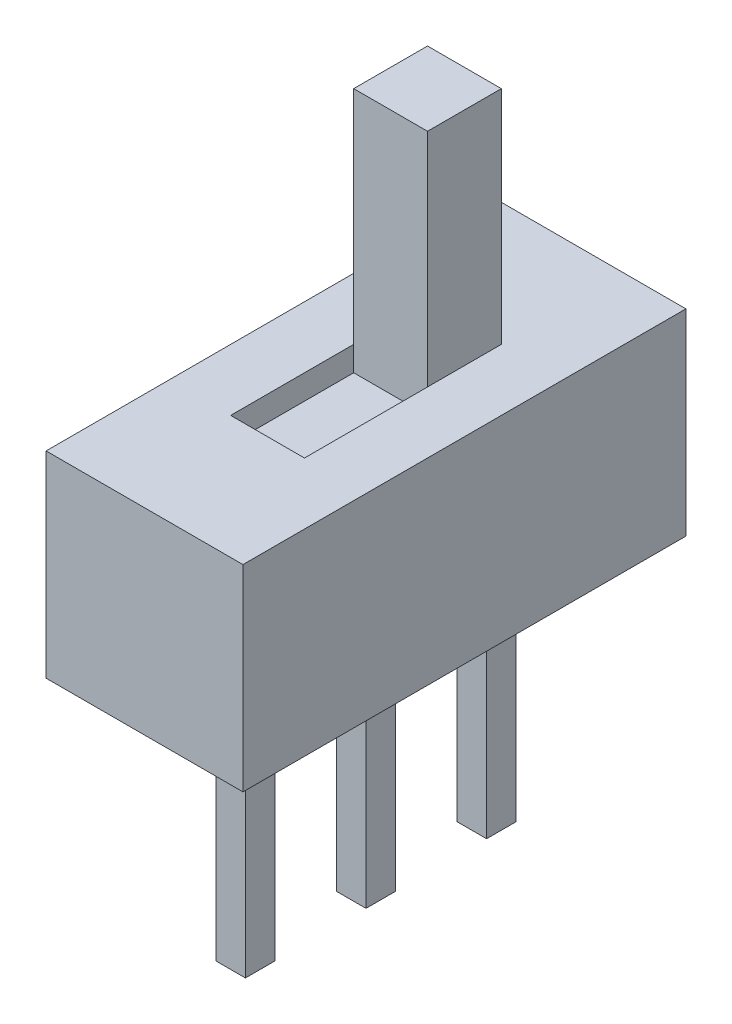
from build123d import *

# Parameters (mm, degrees)
SKETCH_1_W          = 4
SKETCH_1_H          = 4
EXTRUDE_1_DEPTH     = 9
SKETCH_2_W          = 1.5
SKETCH_2_H          = 1.5
EXTRUDE_2_DEPTH     = 4.5
SKETCH_3_W          = 1.5
SKETCH_3_H          = 2.5
CUT_EXTRUDE_1_DEPTH = 0.5
SKETCH_4_W          = 0.6
SKETCH_4_H          = 0.6
EXTRUDE_3_DEPTH     = 5


with BuildPart() as part:
    # Sketch 1 → Extrude 1 (new body)
    with BuildSketch(Plane.XY):
        with Locations((2, 2)):
            Rectangle(SKETCH_1_W, SKETCH_1_H)
    extrude(amount=EXTRUDE_1_DEPTH)

    # Sketch 2 → Extrude 2 (add)
    with BuildSketch(Plane(origin=(0, 4, 0), x_dir=(1, 0, 0), z_dir=(0, 1, 0))):
        with Locations((2, -3.25)):
            Rectangle(SKETCH_2_W, SKETCH_2_H)
    extrude(amount=EXTRUDE_2_DEPTH)

    # Sketch 3 → Cut-Extrude 1 (cut)
    with BuildSketch(Plane(origin=(0, 4, 0), x_dir=(1, 0, 0), z_dir=(0, 1, 0))):
        with Locations((2, -5.25)):
            Rectangle(SKETCH_3_W, SKETCH_3_H)
    extrude(amount=-CUT_EXTRUDE_1_DEPTH, mode=Mode.SUBTRACT)

    # Sketch 4 → Extrude 3 (add)
    with BuildSketch(Plane.XZ):
        with Locations((2, 2.05)):
            Rectangle(SKETCH_4_W, SKETCH_4_H)
        with Locations((2, 6.95)):
            Rectangle(SKETCH_4_W, SKETCH_4_H)
        with Locations((2, 4.5)):
            Rectangle(SKETCH_4_W, SKETCH_4_H)
    extrude(amount=EXTRUDE_3_DEPTH)


solid = part.part
